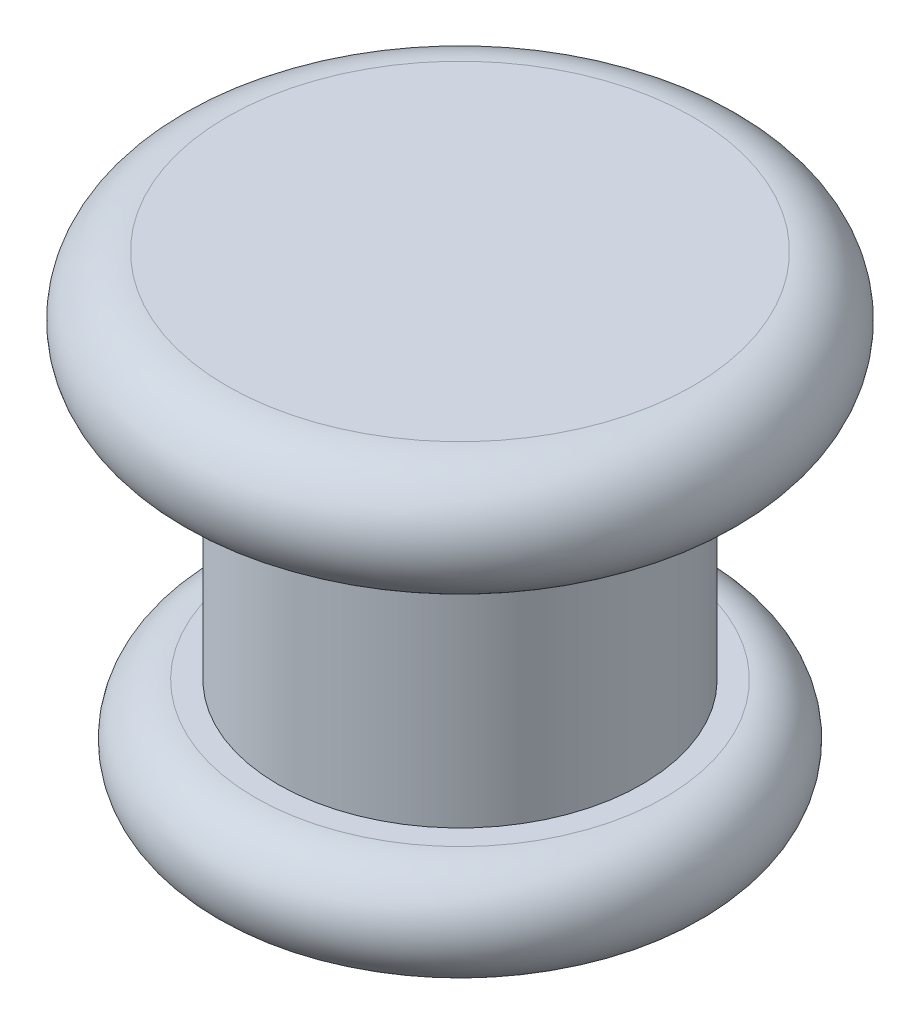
ISO-10303-21;
HEADER;
FILE_DESCRIPTION(('STEP AP214'),'2;1');
FILE_NAME('part.step','',(''),(''),'','','');
FILE_SCHEMA(('AUTOMOTIVE_DESIGN { 1 0 10303 214 1 1 1 1 }'));
ENDSEC;
DATA;
#1=APPLICATION_CONTEXT('core data for automotive mechanical design processes');
#2=APPLICATION_PROTOCOL_DEFINITION('international standard','automotive_design',2000,#1);
#3=PRODUCT_CONTEXT('',#1,'mechanical');
#4=PRODUCT('Part','Part','',(#3));
#5=PRODUCT_RELATED_PRODUCT_CATEGORY('part','',(#4));
#6=PRODUCT_DEFINITION_FORMATION('','',#4);
#7=PRODUCT_DEFINITION_CONTEXT('part definition',#1,'design');
#8=PRODUCT_DEFINITION('design','',#6,#7);
#9=PRODUCT_DEFINITION_SHAPE('','',#8);
#10=(LENGTH_UNIT() NAMED_UNIT(*) SI_UNIT(.MILLI.,.METRE.));
#11=(NAMED_UNIT(*) PLANE_ANGLE_UNIT() SI_UNIT($,.RADIAN.));
#12=(NAMED_UNIT(*) SI_UNIT($,.STERADIAN.) SOLID_ANGLE_UNIT());
#13=UNCERTAINTY_MEASURE_WITH_UNIT(LENGTH_MEASURE(1.E-05),#10,'distance_accuracy_value','');
#14=(GEOMETRIC_REPRESENTATION_CONTEXT(3) GLOBAL_UNCERTAINTY_ASSIGNED_CONTEXT((#13)) GLOBAL_UNIT_ASSIGNED_CONTEXT((#10,
#11,#12)) REPRESENTATION_CONTEXT('',''));
#15=CARTESIAN_POINT('',(0.,0.,0.));
#16=DIRECTION('',(0.,0.,1.));
#17=DIRECTION('',(1.,0.,0.));
#18=AXIS2_PLACEMENT_3D('',#15,#16,#17);
#19=CARTESIAN_POINT('',(0.,-2.5781,0.));
#20=DIRECTION('',(0.,1.,0.));
#21=DIRECTION('',(0.,0.,1.));
#22=AXIS2_PLACEMENT_3D('',#19,#20,#21);
#23=TOROIDAL_SURFACE('',#22,10.1219,2.5781);
#24=CARTESIAN_POINT('',(0.,0.,0.));
#25=DIRECTION('',(0.,1.,0.));
#26=DIRECTION('',(0.,0.,1.));
#27=AXIS2_PLACEMENT_3D('',#24,#25,#26);
#28=CIRCLE('',#27,10.1219);
#29=CARTESIAN_POINT('',(0.,0.,10.1219));
#30=VERTEX_POINT('',#29);
#31=EDGE_CURVE('E10',#30,#30,#28,.T.);
#32=ORIENTED_EDGE('',*,*,#31,.F.);
#33=EDGE_LOOP('',(#32));
#34=FACE_BOUND('',#33,.T.);
#35=CARTESIAN_POINT('',(0.,-5.1562,0.));
#36=DIRECTION('',(0.,1.,0.));
#37=DIRECTION('',(0.,0.,1.));
#38=AXIS2_PLACEMENT_3D('',#35,#36,#37);
#39=CIRCLE('',#38,10.1219);
#40=CARTESIAN_POINT('',(0.,-5.1562,10.1219));
#41=VERTEX_POINT('',#40);
#42=EDGE_CURVE('E386',#41,#41,#39,.T.);
#43=ORIENTED_EDGE('',*,*,#42,.T.);
#44=EDGE_LOOP('',(#43));
#45=FACE_BOUND('',#44,.T.);
#46=ADVANCED_FACE('F364',(#34,#45),#23,.T.);
#47=CARTESIAN_POINT('',(0.,0.,0.));
#48=DIRECTION('',(0.,-1.,0.));
#49=DIRECTION('',(0.,0.,-1.));
#50=AXIS2_PLACEMENT_3D('',#47,#48,#49);
#51=PLANE('',#50);
#52=ORIENTED_EDGE('',*,*,#31,.T.);
#53=EDGE_LOOP('',(#52));
#54=FACE_BOUND('',#53,.T.);
#55=ADVANCED_FACE('F416',(#54),#51,.F.);
#56=CARTESIAN_POINT('',(8.89,-20.5486,0.));
#57=DIRECTION('',(0.,1.,0.));
#58=DIRECTION('',(0.,0.,1.));
#59=AXIS2_PLACEMENT_3D('',#56,#57,#58);
#60=PLANE('',#59);
#61=CARTESIAN_POINT('',(0.,-20.5486,0.));
#62=DIRECTION('',(0.,1.,0.));
#63=DIRECTION('',(0.,0.,1.));
#64=AXIS2_PLACEMENT_3D('',#61,#62,#63);
#65=CIRCLE('',#64,8.89);
#66=CARTESIAN_POINT('',(0.,-20.5486,8.89));
#67=VERTEX_POINT('',#66);
#68=EDGE_CURVE('E370',#67,#67,#65,.T.);
#69=ORIENTED_EDGE('',*,*,#68,.F.);
#70=EDGE_LOOP('',(#69));
#71=FACE_BOUND('',#70,.T.);
#72=ADVANCED_FACE('F411',(#71),#60,.F.);
#73=CARTESIAN_POINT('',(0.,-18.3261,0.));
#74=DIRECTION('',(0.,1.,0.));
#75=DIRECTION('',(0.,0.,1.));
#76=AXIS2_PLACEMENT_3D('',#73,#74,#75);
#77=TOROIDAL_SURFACE('',#76,8.89,2.2225);
#78=CARTESIAN_POINT('',(0.,-16.1036,0.));
#79=DIRECTION('',(0.,1.,0.));
#80=DIRECTION('',(0.,0.,1.));
#81=AXIS2_PLACEMENT_3D('',#78,#79,#80);
#82=CIRCLE('',#81,8.89);
#83=CARTESIAN_POINT('',(0.,-16.1036,8.89));
#84=VERTEX_POINT('',#83);
#85=EDGE_CURVE('E374',#84,#84,#82,.T.);
#86=ORIENTED_EDGE('',*,*,#85,.F.);
#87=EDGE_LOOP('',(#86));
#88=FACE_BOUND('',#87,.T.);
#89=ORIENTED_EDGE('',*,*,#68,.T.);
#90=EDGE_LOOP('',(#89));
#91=FACE_BOUND('',#90,.T.);
#92=ADVANCED_FACE('F406',(#88,#91),#77,.T.);
#93=CARTESIAN_POINT('',(7.8994,-16.1036,0.));
#94=DIRECTION('',(0.,-1.,0.));
#95=DIRECTION('',(0.,0.,-1.));
#96=AXIS2_PLACEMENT_3D('',#93,#94,#95);
#97=PLANE('',#96);
#98=CARTESIAN_POINT('',(0.,-16.1036,0.));
#99=DIRECTION('',(0.,1.,0.));
#100=DIRECTION('',(0.,0.,1.));
#101=AXIS2_PLACEMENT_3D('',#98,#99,#100);
#102=CIRCLE('',#101,7.8994);
#103=CARTESIAN_POINT('',(0.,-16.1036,7.8994));
#104=VERTEX_POINT('',#103);
#105=EDGE_CURVE('E378',#104,#104,#102,.T.);
#106=ORIENTED_EDGE('',*,*,#105,.F.);
#107=EDGE_LOOP('',(#106));
#108=FACE_BOUND('',#107,.T.);
#109=ORIENTED_EDGE('',*,*,#85,.T.);
#110=EDGE_LOOP('',(#109));
#111=FACE_BOUND('',#110,.T.);
#112=ADVANCED_FACE('F400',(#108,#111),#97,.F.);
#113=CARTESIAN_POINT('',(0.,5.72067788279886,0.));
#114=DIRECTION('',(0.,1.,0.));
#115=DIRECTION('',(0.,0.,1.));
#116=AXIS2_PLACEMENT_3D('',#113,#114,#115);
#117=CYLINDRICAL_SURFACE('',#116,7.8994);
#118=CARTESIAN_POINT('',(0.,-5.1562,0.));
#119=DIRECTION('',(0.,1.,0.));
#120=DIRECTION('',(0.,0.,1.));
#121=AXIS2_PLACEMENT_3D('',#118,#119,#120);
#122=CIRCLE('',#121,7.8994);
#123=CARTESIAN_POINT('',(0.,-5.1562,7.8994));
#124=VERTEX_POINT('',#123);
#125=EDGE_CURVE('E383',#124,#124,#122,.T.);
#126=ORIENTED_EDGE('',*,*,#125,.F.);
#127=EDGE_LOOP('',(#126));
#128=FACE_BOUND('',#127,.T.);
#129=ORIENTED_EDGE('',*,*,#105,.T.);
#130=EDGE_LOOP('',(#129));
#131=FACE_BOUND('',#130,.T.);
#132=ADVANCED_FACE('F394',(#128,#131),#117,.T.);
#133=CARTESIAN_POINT('',(10.1219,-5.1562,0.));
#134=DIRECTION('',(0.,1.,0.));
#135=DIRECTION('',(0.,0.,1.));
#136=AXIS2_PLACEMENT_3D('',#133,#134,#135);
#137=PLANE('',#136);
#138=ORIENTED_EDGE('',*,*,#42,.F.);
#139=EDGE_LOOP('',(#138));
#140=FACE_BOUND('',#139,.T.);
#141=ORIENTED_EDGE('',*,*,#125,.T.);
#142=EDGE_LOOP('',(#141));
#143=FACE_BOUND('',#142,.T.);
#144=ADVANCED_FACE('F391',(#140,#143),#137,.F.);
#145=CLOSED_SHELL('',(#46,#55,#72,#92,#112,#132,#144));
#146=MANIFOLD_SOLID_BREP('B2',#145);
#147=ADVANCED_BREP_SHAPE_REPRESENTATION('',(#18,#146),#14);
#148=SHAPE_DEFINITION_REPRESENTATION(#9,#147);
ENDSEC;
END-ISO-10303-21;
